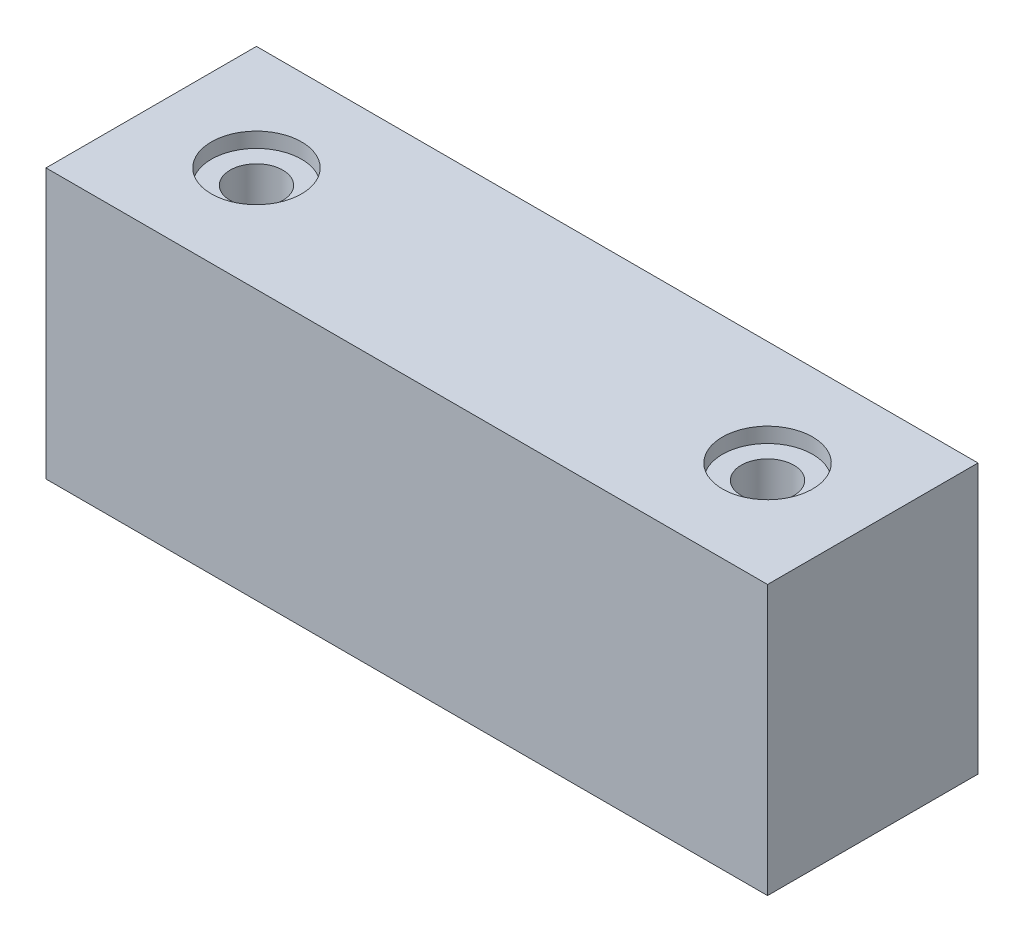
from build123d import *

# Parameters (mm, degrees)
SKETCH1_W           = 304.8
SKETCH1_H           = 113.830905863
BOSS_EXTRUDE1_DEPTH = 88.9
SKETCH2_R           = 19.05
CUT_EXTRUDE1_DEPTH  = 6.35
SKETCH3_R           = 11.1125
CUT_EXTRUDE2_DEPTH  = 226.019242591


with BuildPart() as part:
    # Sketch1 → Boss-Extrude1 (new body)
    with BuildSketch(Plane.XY):
        with Locations((24.173793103, -76.565926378)):
            Rectangle(SKETCH1_W, SKETCH1_H)
    extrude(amount=BOSS_EXTRUDE1_DEPTH)

    # Sketch2 → Cut-Extrude1 (cut)
    with BuildSketch(Plane(origin=(0, -19.650473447, 0), x_dir=(1, 0, 0), z_dir=(0, 1, 0))):
        with Locations(Location((-83.776206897, -44.45, 0), (0, 0, 270))):
            Circle(SKETCH2_R)
        with Locations(Location((132.123793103, -44.45, 0), (0, 0, 90))):
            Circle(SKETCH2_R)
    extrude(amount=-CUT_EXTRUDE1_DEPTH, mode=Mode.SUBTRACT)

    # Sketch3 → Cut-Extrude2 (cut, through all)
    with BuildSketch(Plane(origin=(0, -26.000473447, 0), x_dir=(1, 0, 0), z_dir=(0, 1, 0))):
        with Locations(Location((-83.776206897, -44.45, 0), (0, 0, 270))):
            Circle(SKETCH3_R)
        with Locations(Location((132.123793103, -44.45, 0), (0, 0, 270))):
            Circle(SKETCH3_R)
    extrude(amount=-CUT_EXTRUDE2_DEPTH, mode=Mode.SUBTRACT)


solid = part.part
